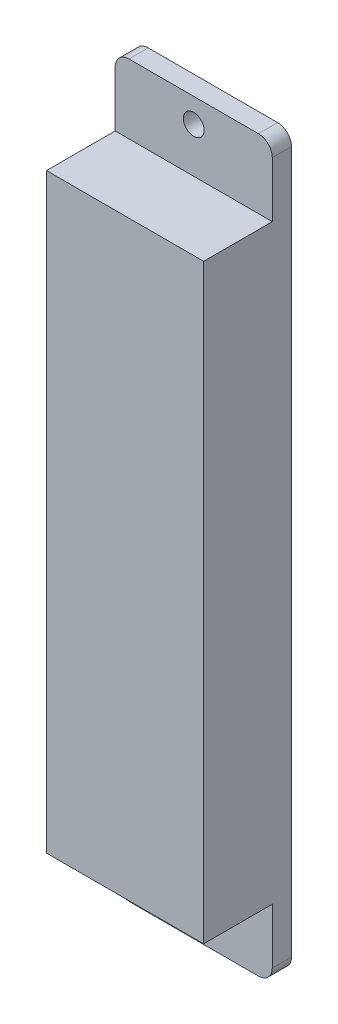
ISO-10303-21;
HEADER;
FILE_DESCRIPTION(('STEP AP214'),'2;1');
FILE_NAME('part.step','',(''),(''),'','','');
FILE_SCHEMA(('AUTOMOTIVE_DESIGN { 1 0 10303 214 1 1 1 1 }'));
ENDSEC;
DATA;
#1=APPLICATION_CONTEXT('core data for automotive mechanical design processes');
#2=APPLICATION_PROTOCOL_DEFINITION('international standard','automotive_design',2000,#1);
#3=PRODUCT_CONTEXT('',#1,'mechanical');
#4=PRODUCT('Part','Part','',(#3));
#5=PRODUCT_RELATED_PRODUCT_CATEGORY('part','',(#4));
#6=PRODUCT_DEFINITION_FORMATION('','',#4);
#7=PRODUCT_DEFINITION_CONTEXT('part definition',#1,'design');
#8=PRODUCT_DEFINITION('design','',#6,#7);
#9=PRODUCT_DEFINITION_SHAPE('','',#8);
#10=(LENGTH_UNIT() NAMED_UNIT(*) SI_UNIT(.MILLI.,.METRE.));
#11=(NAMED_UNIT(*) PLANE_ANGLE_UNIT() SI_UNIT($,.RADIAN.));
#12=(NAMED_UNIT(*) SI_UNIT($,.STERADIAN.) SOLID_ANGLE_UNIT());
#13=UNCERTAINTY_MEASURE_WITH_UNIT(LENGTH_MEASURE(1.E-05),#10,'distance_accuracy_value','');
#14=(GEOMETRIC_REPRESENTATION_CONTEXT(3) GLOBAL_UNCERTAINTY_ASSIGNED_CONTEXT((#13)) GLOBAL_UNIT_ASSIGNED_CONTEXT((#10,
#11,#12)) REPRESENTATION_CONTEXT('',''));
#15=CARTESIAN_POINT('',(0.,0.,0.));
#16=DIRECTION('',(0.,0.,1.));
#17=DIRECTION('',(1.,0.,0.));
#18=AXIS2_PLACEMENT_3D('',#15,#16,#17);
#19=CARTESIAN_POINT('',(0.,42.6999999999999,10.2));
#20=DIRECTION('',(0.,1.,0.));
#21=DIRECTION('',(0.,0.,1.));
#22=AXIS2_PLACEMENT_3D('',#19,#20,#21);
#23=PLANE('',#22);
#24=DIRECTION('',(0.,0.,-1.));
#25=VECTOR('',#24,1.);
#26=CARTESIAN_POINT('',(123.3,42.6999999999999,10.2));
#27=LINE('',#26,#25);
#28=CARTESIAN_POINT('',(123.3,42.6999999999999,12.7));
#29=VERTEX_POINT('',#28);
#30=CARTESIAN_POINT('',(123.3,42.7000000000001,2.77863936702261));
#31=VERTEX_POINT('',#30);
#32=EDGE_CURVE('E159',#29,#31,#27,.T.);
#33=ORIENTED_EDGE('',*,*,#32,.T.);
#34=DIRECTION('',(-1.,0.,0.));
#35=VECTOR('',#34,1.);
#36=CARTESIAN_POINT('',(0.,42.7000000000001,2.7786393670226));
#37=LINE('',#36,#35);
#38=CARTESIAN_POINT('',(100.6,42.6999999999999,2.77863936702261));
#39=VERTEX_POINT('',#38);
#40=EDGE_CURVE('E168',#31,#39,#37,.T.);
#41=ORIENTED_EDGE('',*,*,#40,.T.);
#42=DIRECTION('',(0.,0.,-1.));
#43=VECTOR('',#42,1.);
#44=CARTESIAN_POINT('',(100.6,42.6999999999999,10.2));
#45=LINE('',#44,#43);
#46=CARTESIAN_POINT('',(100.6,42.6999999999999,12.7));
#47=VERTEX_POINT('',#46);
#48=EDGE_CURVE('E180',#47,#39,#45,.T.);
#49=ORIENTED_EDGE('',*,*,#48,.F.);
#50=DIRECTION('',(-1.,0.,0.));
#51=VECTOR('',#50,1.);
#52=CARTESIAN_POINT('',(0.,42.6999999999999,12.7));
#53=LINE('',#52,#51);
#54=EDGE_CURVE('E178',#29,#47,#53,.T.);
#55=ORIENTED_EDGE('',*,*,#54,.F.);
#56=EDGE_LOOP('',(#33,#41,#49,#55));
#57=FACE_BOUND('',#56,.T.);
#58=ADVANCED_FACE('F42',(#57),#23,.T.);
#59=CARTESIAN_POINT('',(0.,-42.7000000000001,10.2));
#60=DIRECTION('',(0.,1.,0.));
#61=DIRECTION('',(0.,0.,1.));
#62=AXIS2_PLACEMENT_3D('',#59,#60,#61);
#63=PLANE('',#62);
#64=DIRECTION('',(-1.,0.,0.));
#65=VECTOR('',#64,1.);
#66=CARTESIAN_POINT('',(0.,-42.7000000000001,2.7786393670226));
#67=LINE('',#66,#65);
#68=CARTESIAN_POINT('',(123.3,-42.7000000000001,2.77863936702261));
#69=VERTEX_POINT('',#68);
#70=CARTESIAN_POINT('',(100.6,-42.7000000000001,2.77863936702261));
#71=VERTEX_POINT('',#70);
#72=EDGE_CURVE('E229',#69,#71,#67,.T.);
#73=ORIENTED_EDGE('',*,*,#72,.F.);
#74=DIRECTION('',(0.,0.,-1.));
#75=VECTOR('',#74,1.);
#76=CARTESIAN_POINT('',(123.3,-42.7000000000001,10.2));
#77=LINE('',#76,#75);
#78=CARTESIAN_POINT('',(123.3,-42.7000000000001,12.7));
#79=VERTEX_POINT('',#78);
#80=EDGE_CURVE('E179',#79,#69,#77,.T.);
#81=ORIENTED_EDGE('',*,*,#80,.F.);
#82=DIRECTION('',(1.,0.,0.));
#83=VECTOR('',#82,1.);
#84=CARTESIAN_POINT('',(0.,-42.7000000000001,12.7));
#85=LINE('',#84,#83);
#86=CARTESIAN_POINT('',(100.6,-42.7000000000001,12.7));
#87=VERTEX_POINT('',#86);
#88=EDGE_CURVE('E261',#87,#79,#85,.T.);
#89=ORIENTED_EDGE('',*,*,#88,.F.);
#90=DIRECTION('',(0.,0.,-1.));
#91=VECTOR('',#90,1.);
#92=CARTESIAN_POINT('',(100.6,-42.7000000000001,10.2));
#93=LINE('',#92,#91);
#94=EDGE_CURVE('E183',#87,#71,#93,.T.);
#95=ORIENTED_EDGE('',*,*,#94,.T.);
#96=EDGE_LOOP('',(#73,#81,#89,#95));
#97=FACE_BOUND('',#96,.T.);
#98=ADVANCED_FACE('F312',(#97),#63,.F.);
#99=CARTESIAN_POINT('',(0.,-40.2000000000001,10.2));
#100=DIRECTION('',(0.,1.,0.));
#101=DIRECTION('',(0.,0.,1.));
#102=AXIS2_PLACEMENT_3D('',#99,#100,#101);
#103=PLANE('',#102);
#104=DIRECTION('',(1.,0.,0.));
#105=VECTOR('',#104,1.);
#106=CARTESIAN_POINT('',(0.,-40.2000000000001,0.));
#107=LINE('',#106,#105);
#108=CARTESIAN_POINT('',(100.6,-40.2000000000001,0.));
#109=VERTEX_POINT('',#108);
#110=CARTESIAN_POINT('',(115.8,-40.2000000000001,0.));
#111=VERTEX_POINT('',#110);
#112=EDGE_CURVE('E267',#109,#111,#107,.T.);
#113=ORIENTED_EDGE('',*,*,#112,.F.);
#114=DIRECTION('',(0.,0.,-1.));
#115=VECTOR('',#114,1.);
#116=CARTESIAN_POINT('',(100.6,-40.2000000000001,10.2));
#117=LINE('',#116,#115);
#118=CARTESIAN_POINT('',(100.6,-40.2000000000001,10.2));
#119=VERTEX_POINT('',#118);
#120=EDGE_CURVE('E191',#119,#109,#117,.T.);
#121=ORIENTED_EDGE('',*,*,#120,.F.);
#122=DIRECTION('',(1.,0.,0.));
#123=VECTOR('',#122,1.);
#124=CARTESIAN_POINT('',(0.,-40.2000000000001,10.2));
#125=LINE('',#124,#123);
#126=CARTESIAN_POINT('',(115.8,-40.2000000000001,10.2));
#127=VERTEX_POINT('',#126);
#128=EDGE_CURVE('E269',#119,#127,#125,.T.);
#129=ORIENTED_EDGE('',*,*,#128,.T.);
#130=DIRECTION('',(0.,0.,-1.));
#131=VECTOR('',#130,1.);
#132=CARTESIAN_POINT('',(115.8,-40.2000000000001,10.2));
#133=LINE('',#132,#131);
#134=EDGE_CURVE('E278',#127,#111,#133,.T.);
#135=ORIENTED_EDGE('',*,*,#134,.T.);
#136=EDGE_LOOP('',(#113,#121,#129,#135));
#137=FACE_BOUND('',#136,.T.);
#138=ADVANCED_FACE('F310',(#137),#103,.T.);
#139=CARTESIAN_POINT('',(123.3,0.,10.2));
#140=DIRECTION('',(1.,0.,0.));
#141=DIRECTION('',(0.,1.,0.));
#142=AXIS2_PLACEMENT_3D('',#139,#140,#141);
#143=PLANE('',#142);
#144=DIRECTION('',(0.,1.,0.));
#145=VECTOR('',#144,1.);
#146=CARTESIAN_POINT('',(123.3,-52.7000000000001,2.77863936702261));
#147=LINE('',#146,#145);
#148=CARTESIAN_POINT('',(123.3,-50.7000000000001,2.77863936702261));
#149=VERTEX_POINT('',#148);
#150=EDGE_CURVE('E256',#149,#69,#147,.T.);
#151=ORIENTED_EDGE('',*,*,#150,.F.);
#152=DIRECTION('',(0.,0.,1.));
#153=VECTOR('',#152,1.);
#154=CARTESIAN_POINT('',(123.3,-50.7000000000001,10.2));
#155=LINE('',#154,#153);
#156=CARTESIAN_POINT('',(123.3,-50.7000000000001,0.));
#157=VERTEX_POINT('',#156);
#158=EDGE_CURVE('E204',#149,#157,#155,.F.);
#159=ORIENTED_EDGE('',*,*,#158,.T.);
#160=DIRECTION('',(0.,-1.,0.));
#161=VECTOR('',#160,1.);
#162=CARTESIAN_POINT('',(123.3,0.,0.));
#163=LINE('',#162,#161);
#164=CARTESIAN_POINT('',(123.3,50.7000000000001,0.));
#165=VERTEX_POINT('',#164);
#166=EDGE_CURVE('E283',#165,#157,#163,.T.);
#167=ORIENTED_EDGE('',*,*,#166,.F.);
#168=DIRECTION('',(0.,0.,1.));
#169=VECTOR('',#168,1.);
#170=CARTESIAN_POINT('',(123.3,50.7000000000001,10.2));
#171=LINE('',#170,#169);
#172=CARTESIAN_POINT('',(123.3,50.7000000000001,2.77863936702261));
#173=VERTEX_POINT('',#172);
#174=EDGE_CURVE('E163',#165,#173,#171,.T.);
#175=ORIENTED_EDGE('',*,*,#174,.T.);
#176=DIRECTION('',(0.,-1.,0.));
#177=VECTOR('',#176,1.);
#178=CARTESIAN_POINT('',(123.3,52.7000000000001,2.77863936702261));
#179=LINE('',#178,#177);
#180=EDGE_CURVE('E153',#173,#31,#179,.T.);
#181=ORIENTED_EDGE('',*,*,#180,.T.);
#182=ORIENTED_EDGE('',*,*,#32,.F.);
#183=DIRECTION('',(0.,1.,0.));
#184=VECTOR('',#183,1.);
#185=CARTESIAN_POINT('',(123.3,0.,12.7));
#186=LINE('',#185,#184);
#187=EDGE_CURVE('E264',#79,#29,#186,.T.);
#188=ORIENTED_EDGE('',*,*,#187,.F.);
#189=ORIENTED_EDGE('',*,*,#80,.T.);
#190=EDGE_LOOP('',(#151,#159,#167,#175,#181,#182,#188,#189));
#191=FACE_BOUND('',#190,.T.);
#192=ADVANCED_FACE('F156',(#191),#143,.T.);
#193=CARTESIAN_POINT('',(100.6,0.,10.2));
#194=DIRECTION('',(1.,0.,0.));
#195=DIRECTION('',(0.,0.,-1.));
#196=AXIS2_PLACEMENT_3D('',#193,#194,#195);
#197=PLANE('',#196);
#198=DIRECTION('',(0.,-1.,0.));
#199=VECTOR('',#198,1.);
#200=CARTESIAN_POINT('',(100.6,0.,0.));
#201=LINE('',#200,#199);
#202=CARTESIAN_POINT('',(100.6,-50.7000000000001,0.));
#203=VERTEX_POINT('',#202);
#204=EDGE_CURVE('E281',#109,#203,#201,.T.);
#205=ORIENTED_EDGE('',*,*,#204,.T.);
#206=DIRECTION('',(0.,0.,-1.));
#207=VECTOR('',#206,1.);
#208=CARTESIAN_POINT('',(100.6,-50.7000000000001,2.77863936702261));
#209=LINE('',#208,#207);
#210=CARTESIAN_POINT('',(100.6,-50.7000000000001,2.77863936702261));
#211=VERTEX_POINT('',#210);
#212=EDGE_CURVE('E217',#203,#211,#209,.F.);
#213=ORIENTED_EDGE('',*,*,#212,.T.);
#214=DIRECTION('',(0.,1.,0.));
#215=VECTOR('',#214,1.);
#216=CARTESIAN_POINT('',(100.6,-52.7000000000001,2.77863936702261));
#217=LINE('',#216,#215);
#218=EDGE_CURVE('E252',#211,#71,#217,.T.);
#219=ORIENTED_EDGE('',*,*,#218,.T.);
#220=ORIENTED_EDGE('',*,*,#94,.F.);
#221=DIRECTION('',(0.,1.,0.));
#222=VECTOR('',#221,1.);
#223=CARTESIAN_POINT('',(100.6,0.,12.7));
#224=LINE('',#223,#222);
#225=EDGE_CURVE('E259',#87,#47,#224,.T.);
#226=ORIENTED_EDGE('',*,*,#225,.T.);
#227=ORIENTED_EDGE('',*,*,#48,.T.);
#228=DIRECTION('',(0.,-1.,0.));
#229=VECTOR('',#228,1.);
#230=CARTESIAN_POINT('',(100.6,52.7000000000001,2.77863936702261));
#231=LINE('',#230,#229);
#232=CARTESIAN_POINT('',(100.6,50.7000000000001,2.77863936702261));
#233=VERTEX_POINT('',#232);
#234=EDGE_CURVE('E164',#233,#39,#231,.T.);
#235=ORIENTED_EDGE('',*,*,#234,.F.);
#236=DIRECTION('',(0.,0.,-1.));
#237=VECTOR('',#236,1.);
#238=CARTESIAN_POINT('',(100.6,50.7000000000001,0.));
#239=LINE('',#238,#237);
#240=CARTESIAN_POINT('',(100.6,50.7000000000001,0.));
#241=VERTEX_POINT('',#240);
#242=EDGE_CURVE('E214',#233,#241,#239,.T.);
#243=ORIENTED_EDGE('',*,*,#242,.T.);
#244=DIRECTION('',(0.,-1.,0.));
#245=VECTOR('',#244,1.);
#246=CARTESIAN_POINT('',(100.6,0.,0.));
#247=LINE('',#246,#245);
#248=CARTESIAN_POINT('',(100.6,40.1999999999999,0.));
#249=VERTEX_POINT('',#248);
#250=EDGE_CURVE('E237',#241,#249,#247,.T.);
#251=ORIENTED_EDGE('',*,*,#250,.T.);
#252=DIRECTION('',(0.,0.,-1.));
#253=VECTOR('',#252,1.);
#254=CARTESIAN_POINT('',(100.6,40.1999999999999,10.2));
#255=LINE('',#254,#253);
#256=CARTESIAN_POINT('',(100.6,40.1999999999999,10.2));
#257=VERTEX_POINT('',#256);
#258=EDGE_CURVE('E185',#257,#249,#255,.T.);
#259=ORIENTED_EDGE('',*,*,#258,.F.);
#260=DIRECTION('',(0.,1.,0.));
#261=VECTOR('',#260,1.);
#262=CARTESIAN_POINT('',(100.6,0.,10.2));
#263=LINE('',#262,#261);
#264=EDGE_CURVE('E258',#119,#257,#263,.T.);
#265=ORIENTED_EDGE('',*,*,#264,.F.);
#266=ORIENTED_EDGE('',*,*,#120,.T.);
#267=EDGE_LOOP('',(#205,#213,#219,#220,#226,#227,#235,#243,#251,#259,#265,#266));
#268=FACE_BOUND('',#267,.T.);
#269=ADVANCED_FACE('F226',(#268),#197,.F.);
#270=CARTESIAN_POINT('',(0.,40.1999999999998,10.2));
#271=DIRECTION('',(0.,1.,0.));
#272=DIRECTION('',(-1.,0.,0.));
#273=AXIS2_PLACEMENT_3D('',#270,#271,#272);
#274=PLANE('',#273);
#275=DIRECTION('',(1.,0.,0.));
#276=VECTOR('',#275,1.);
#277=CARTESIAN_POINT('',(0.,40.1999999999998,0.));
#278=LINE('',#277,#276);
#279=CARTESIAN_POINT('',(115.8,40.1999999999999,0.));
#280=VERTEX_POINT('',#279);
#281=EDGE_CURVE('E286',#249,#280,#278,.T.);
#282=ORIENTED_EDGE('',*,*,#281,.T.);
#283=DIRECTION('',(0.,0.,-1.));
#284=VECTOR('',#283,1.);
#285=CARTESIAN_POINT('',(115.8,40.1999999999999,10.2));
#286=LINE('',#285,#284);
#287=CARTESIAN_POINT('',(115.8,40.1999999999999,10.2));
#288=VERTEX_POINT('',#287);
#289=EDGE_CURVE('E292',#288,#280,#286,.T.);
#290=ORIENTED_EDGE('',*,*,#289,.F.);
#291=DIRECTION('',(1.,0.,0.));
#292=VECTOR('',#291,1.);
#293=CARTESIAN_POINT('',(0.,40.1999999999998,10.2));
#294=LINE('',#293,#292);
#295=EDGE_CURVE('E272',#257,#288,#294,.T.);
#296=ORIENTED_EDGE('',*,*,#295,.F.);
#297=ORIENTED_EDGE('',*,*,#258,.T.);
#298=EDGE_LOOP('',(#282,#290,#296,#297));
#299=FACE_BOUND('',#298,.T.);
#300=ADVANCED_FACE('F297',(#299),#274,.F.);
#301=CARTESIAN_POINT('',(115.8,0.,10.2));
#302=DIRECTION('',(-1.,0.,0.));
#303=DIRECTION('',(0.,-1.,0.));
#304=AXIS2_PLACEMENT_3D('',#301,#302,#303);
#305=PLANE('',#304);
#306=DIRECTION('',(0.,1.,0.));
#307=VECTOR('',#306,1.);
#308=CARTESIAN_POINT('',(115.8,0.,0.));
#309=LINE('',#308,#307);
#310=EDGE_CURVE('E273',#111,#280,#309,.T.);
#311=ORIENTED_EDGE('',*,*,#310,.F.);
#312=ORIENTED_EDGE('',*,*,#134,.F.);
#313=DIRECTION('',(0.,1.,0.));
#314=VECTOR('',#313,1.);
#315=CARTESIAN_POINT('',(115.8,0.,10.2));
#316=LINE('',#315,#314);
#317=EDGE_CURVE('E275',#127,#288,#316,.T.);
#318=ORIENTED_EDGE('',*,*,#317,.T.);
#319=ORIENTED_EDGE('',*,*,#289,.T.);
#320=EDGE_LOOP('',(#311,#312,#318,#319));
#321=FACE_BOUND('',#320,.T.);
#322=ADVANCED_FACE('F305',(#321),#305,.T.);
#323=CARTESIAN_POINT('',(0.,0.,0.));
#324=DIRECTION('',(0.,0.,1.));
#325=DIRECTION('',(1.,0.,0.));
#326=AXIS2_PLACEMENT_3D('',#323,#324,#325);
#327=PLANE('',#326);
#328=CARTESIAN_POINT('',(111.95,-49.1999999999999,0.));
#329=DIRECTION('',(0.,0.,-1.));
#330=DIRECTION('',(1.,0.,0.));
#331=AXIS2_PLACEMENT_3D('',#328,#329,#330);
#332=CIRCLE('',#331,1.5);
#333=CARTESIAN_POINT('',(113.45,-49.1999999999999,0.));
#334=VERTEX_POINT('',#333);
#335=EDGE_CURVE('E370',#334,#334,#332,.T.);
#336=ORIENTED_EDGE('',*,*,#335,.F.);
#337=EDGE_LOOP('',(#336));
#338=FACE_BOUND('',#337,.T.);
#339=CARTESIAN_POINT('',(111.95,49.1999999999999,0.));
#340=DIRECTION('',(0.,0.,1.));
#341=DIRECTION('',(1.,0.,0.));
#342=AXIS2_PLACEMENT_3D('',#339,#340,#341);
#343=CIRCLE('',#342,1.5);
#344=CARTESIAN_POINT('',(113.45,49.1999999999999,0.));
#345=VERTEX_POINT('',#344);
#346=EDGE_CURVE('E174',#345,#345,#343,.T.);
#347=ORIENTED_EDGE('',*,*,#346,.T.);
#348=EDGE_LOOP('',(#347));
#349=FACE_BOUND('',#348,.T.);
#350=ORIENTED_EDGE('',*,*,#166,.T.);
#351=CARTESIAN_POINT('',(121.3,-50.7000000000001,0.));
#352=DIRECTION('',(0.,0.,1.));
#353=DIRECTION('',(1.,0.,0.));
#354=AXIS2_PLACEMENT_3D('',#351,#352,#353);
#355=CIRCLE('',#354,2.);
#356=CARTESIAN_POINT('',(121.3,-52.7000000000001,0.));
#357=VERTEX_POINT('',#356);
#358=EDGE_CURVE('E212',#157,#357,#355,.F.);
#359=ORIENTED_EDGE('',*,*,#358,.T.);
#360=DIRECTION('',(1.,0.,0.));
#361=VECTOR('',#360,1.);
#362=CARTESIAN_POINT('',(0.,-52.7000000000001,0.));
#363=LINE('',#362,#361);
#364=CARTESIAN_POINT('',(102.6,-52.7000000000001,0.));
#365=VERTEX_POINT('',#364);
#366=EDGE_CURVE('E249',#365,#357,#363,.T.);
#367=ORIENTED_EDGE('',*,*,#366,.F.);
#368=CARTESIAN_POINT('',(102.6,-50.7000000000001,0.));
#369=DIRECTION('',(0.,0.,1.));
#370=DIRECTION('',(1.,0.,0.));
#371=AXIS2_PLACEMENT_3D('',#368,#369,#370);
#372=CIRCLE('',#371,2.);
#373=EDGE_CURVE('E210',#365,#203,#372,.F.);
#374=ORIENTED_EDGE('',*,*,#373,.T.);
#375=ORIENTED_EDGE('',*,*,#204,.F.);
#376=ORIENTED_EDGE('',*,*,#112,.T.);
#377=ORIENTED_EDGE('',*,*,#310,.T.);
#378=ORIENTED_EDGE('',*,*,#281,.F.);
#379=ORIENTED_EDGE('',*,*,#250,.F.);
#380=CARTESIAN_POINT('',(102.6,50.7000000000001,0.));
#381=DIRECTION('',(0.,0.,1.));
#382=DIRECTION('',(1.,0.,0.));
#383=AXIS2_PLACEMENT_3D('',#380,#381,#382);
#384=CIRCLE('',#383,2.);
#385=CARTESIAN_POINT('',(102.6,52.7000000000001,0.));
#386=VERTEX_POINT('',#385);
#387=EDGE_CURVE('E206',#241,#386,#384,.F.);
#388=ORIENTED_EDGE('',*,*,#387,.T.);
#389=DIRECTION('',(1.,0.,0.));
#390=VECTOR('',#389,1.);
#391=CARTESIAN_POINT('',(0.,52.7000000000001,0.));
#392=LINE('',#391,#390);
#393=CARTESIAN_POINT('',(121.3,52.7000000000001,0.));
#394=VERTEX_POINT('',#393);
#395=EDGE_CURVE('E173',#386,#394,#392,.T.);
#396=ORIENTED_EDGE('',*,*,#395,.T.);
#397=CARTESIAN_POINT('',(121.3,50.7000000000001,0.));
#398=DIRECTION('',(0.,0.,1.));
#399=DIRECTION('',(1.,0.,0.));
#400=AXIS2_PLACEMENT_3D('',#397,#398,#399);
#401=CIRCLE('',#400,2.);
#402=EDGE_CURVE('E208',#394,#165,#401,.F.);
#403=ORIENTED_EDGE('',*,*,#402,.T.);
#404=EDGE_LOOP('',(#350,#359,#367,#374,#375,#376,#377,#378,#379,#388,#396,#403));
#405=FACE_BOUND('',#404,.T.);
#406=ADVANCED_FACE('F234',(#338,#349,#405),#327,.F.);
#407=CARTESIAN_POINT('',(0.,0.,12.7));
#408=DIRECTION('',(0.,0.,1.));
#409=DIRECTION('',(1.,0.,0.));
#410=AXIS2_PLACEMENT_3D('',#407,#408,#409);
#411=PLANE('',#410);
#412=ORIENTED_EDGE('',*,*,#225,.F.);
#413=ORIENTED_EDGE('',*,*,#88,.T.);
#414=ORIENTED_EDGE('',*,*,#187,.T.);
#415=ORIENTED_EDGE('',*,*,#54,.T.);
#416=EDGE_LOOP('',(#412,#413,#414,#415));
#417=FACE_BOUND('',#416,.T.);
#418=ADVANCED_FACE('F336',(#417),#411,.T.);
#419=CARTESIAN_POINT('',(0.,0.,10.2));
#420=DIRECTION('',(0.,0.,1.));
#421=DIRECTION('',(1.,0.,0.));
#422=AXIS2_PLACEMENT_3D('',#419,#420,#421);
#423=PLANE('',#422);
#424=ORIENTED_EDGE('',*,*,#128,.F.);
#425=ORIENTED_EDGE('',*,*,#264,.T.);
#426=ORIENTED_EDGE('',*,*,#295,.T.);
#427=ORIENTED_EDGE('',*,*,#317,.F.);
#428=EDGE_LOOP('',(#424,#425,#426,#427));
#429=FACE_BOUND('',#428,.T.);
#430=ADVANCED_FACE('F307',(#429),#423,.F.);
#431=CARTESIAN_POINT('',(0.,-52.7000000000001,2.7786393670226));
#432=DIRECTION('',(0.,0.,-1.));
#433=DIRECTION('',(-1.,0.,0.));
#434=AXIS2_PLACEMENT_3D('',#431,#432,#433);
#435=PLANE('',#434);
#436=CARTESIAN_POINT('',(111.95,-49.1999999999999,2.7786393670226));
#437=DIRECTION('',(0.,0.,-1.));
#438=DIRECTION('',(1.,0.,0.));
#439=AXIS2_PLACEMENT_3D('',#436,#437,#438);
#440=CIRCLE('',#439,1.5);
#441=CARTESIAN_POINT('',(113.45,-49.1999999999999,2.7786393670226));
#442=VERTEX_POINT('',#441);
#443=EDGE_CURVE('E373',#442,#442,#440,.T.);
#444=ORIENTED_EDGE('',*,*,#443,.T.);
#445=EDGE_LOOP('',(#444));
#446=FACE_BOUND('',#445,.T.);
#447=DIRECTION('',(-1.,0.,0.));
#448=VECTOR('',#447,1.);
#449=CARTESIAN_POINT('',(0.,-52.7000000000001,2.7786393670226));
#450=LINE('',#449,#448);
#451=CARTESIAN_POINT('',(121.3,-52.7000000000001,2.77863936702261));
#452=VERTEX_POINT('',#451);
#453=CARTESIAN_POINT('',(102.6,-52.7000000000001,2.77863936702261));
#454=VERTEX_POINT('',#453);
#455=EDGE_CURVE('E246',#452,#454,#450,.T.);
#456=ORIENTED_EDGE('',*,*,#455,.F.);
#457=CARTESIAN_POINT('',(121.3,-50.7000000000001,2.77863936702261));
#458=DIRECTION('',(0.,0.,-1.));
#459=DIRECTION('',(-1.,0.,0.));
#460=AXIS2_PLACEMENT_3D('',#457,#458,#459);
#461=CIRCLE('',#460,2.);
#462=EDGE_CURVE('E201',#452,#149,#461,.F.);
#463=ORIENTED_EDGE('',*,*,#462,.T.);
#464=ORIENTED_EDGE('',*,*,#150,.T.);
#465=ORIENTED_EDGE('',*,*,#72,.T.);
#466=ORIENTED_EDGE('',*,*,#218,.F.);
#467=CARTESIAN_POINT('',(102.6,-50.7000000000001,2.77863936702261));
#468=DIRECTION('',(0.,0.,-1.));
#469=DIRECTION('',(-1.,0.,0.));
#470=AXIS2_PLACEMENT_3D('',#467,#468,#469);
#471=CIRCLE('',#470,2.);
#472=EDGE_CURVE('E199',#211,#454,#471,.F.);
#473=ORIENTED_EDGE('',*,*,#472,.T.);
#474=EDGE_LOOP('',(#456,#463,#464,#465,#466,#473));
#475=FACE_BOUND('',#474,.T.);
#476=ADVANCED_FACE('F340',(#446,#475),#435,.F.);
#477=CARTESIAN_POINT('',(0.,-52.7000000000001,0.));
#478=DIRECTION('',(0.,-1.,0.));
#479=DIRECTION('',(0.,0.,-1.));
#480=AXIS2_PLACEMENT_3D('',#477,#478,#479);
#481=PLANE('',#480);
#482=ORIENTED_EDGE('',*,*,#366,.T.);
#483=DIRECTION('',(0.,0.,1.));
#484=VECTOR('',#483,1.);
#485=CARTESIAN_POINT('',(121.3,-52.7000000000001,0.));
#486=LINE('',#485,#484);
#487=EDGE_CURVE('E196',#357,#452,#486,.T.);
#488=ORIENTED_EDGE('',*,*,#487,.T.);
#489=ORIENTED_EDGE('',*,*,#455,.T.);
#490=DIRECTION('',(0.,0.,-1.));
#491=VECTOR('',#490,1.);
#492=CARTESIAN_POINT('',(102.6,-52.7000000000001,0.));
#493=LINE('',#492,#491);
#494=EDGE_CURVE('E193',#454,#365,#493,.T.);
#495=ORIENTED_EDGE('',*,*,#494,.T.);
#496=EDGE_LOOP('',(#482,#488,#489,#495));
#497=FACE_BOUND('',#496,.T.);
#498=ADVANCED_FACE('F346',(#497),#481,.T.);
#499=CARTESIAN_POINT('',(0.,52.7000000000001,2.7786393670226));
#500=DIRECTION('',(0.,0.,1.));
#501=DIRECTION('',(1.,0.,0.));
#502=AXIS2_PLACEMENT_3D('',#499,#500,#501);
#503=PLANE('',#502);
#504=CARTESIAN_POINT('',(111.95,49.1999999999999,2.7786393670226));
#505=DIRECTION('',(0.,0.,1.));
#506=DIRECTION('',(1.,0.,0.));
#507=AXIS2_PLACEMENT_3D('',#504,#505,#506);
#508=CIRCLE('',#507,1.5);
#509=CARTESIAN_POINT('',(113.45,49.1999999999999,2.7786393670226));
#510=VERTEX_POINT('',#509);
#511=EDGE_CURVE('E243',#510,#510,#508,.T.);
#512=ORIENTED_EDGE('',*,*,#511,.F.);
#513=EDGE_LOOP('',(#512));
#514=FACE_BOUND('',#513,.T.);
#515=ORIENTED_EDGE('',*,*,#180,.F.);
#516=CARTESIAN_POINT('',(121.3,50.7000000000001,2.77863936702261));
#517=DIRECTION('',(0.,0.,1.));
#518=DIRECTION('',(1.,0.,0.));
#519=AXIS2_PLACEMENT_3D('',#516,#517,#518);
#520=CIRCLE('',#519,2.);
#521=CARTESIAN_POINT('',(121.3,52.7000000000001,2.77863936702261));
#522=VERTEX_POINT('',#521);
#523=EDGE_CURVE('E63',#173,#522,#520,.T.);
#524=ORIENTED_EDGE('',*,*,#523,.T.);
#525=DIRECTION('',(-1.,0.,0.));
#526=VECTOR('',#525,1.);
#527=CARTESIAN_POINT('',(0.,52.7000000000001,2.7786393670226));
#528=LINE('',#527,#526);
#529=CARTESIAN_POINT('',(102.6,52.7000000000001,2.77863936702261));
#530=VERTEX_POINT('',#529);
#531=EDGE_CURVE('E165',#522,#530,#528,.T.);
#532=ORIENTED_EDGE('',*,*,#531,.T.);
#533=CARTESIAN_POINT('',(102.6,50.7000000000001,2.77863936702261));
#534=DIRECTION('',(0.,0.,1.));
#535=DIRECTION('',(1.,0.,0.));
#536=AXIS2_PLACEMENT_3D('',#533,#534,#535);
#537=CIRCLE('',#536,2.);
#538=EDGE_CURVE('E219',#530,#233,#537,.T.);
#539=ORIENTED_EDGE('',*,*,#538,.T.);
#540=ORIENTED_EDGE('',*,*,#234,.T.);
#541=ORIENTED_EDGE('',*,*,#40,.F.);
#542=EDGE_LOOP('',(#515,#524,#532,#539,#540,#541));
#543=FACE_BOUND('',#542,.T.);
#544=ADVANCED_FACE('F169',(#514,#543),#503,.T.);
#545=CARTESIAN_POINT('',(0.,52.7000000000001,0.));
#546=DIRECTION('',(0.,1.,0.));
#547=DIRECTION('',(0.,0.,-1.));
#548=AXIS2_PLACEMENT_3D('',#545,#546,#547);
#549=PLANE('',#548);
#550=ORIENTED_EDGE('',*,*,#531,.F.);
#551=DIRECTION('',(0.,0.,1.));
#552=VECTOR('',#551,1.);
#553=CARTESIAN_POINT('',(121.3,52.7000000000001,0.));
#554=LINE('',#553,#552);
#555=EDGE_CURVE('E12',#522,#394,#554,.F.);
#556=ORIENTED_EDGE('',*,*,#555,.T.);
#557=ORIENTED_EDGE('',*,*,#395,.F.);
#558=DIRECTION('',(0.,0.,-1.));
#559=VECTOR('',#558,1.);
#560=CARTESIAN_POINT('',(102.6,52.7000000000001,2.77863936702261));
#561=LINE('',#560,#559);
#562=EDGE_CURVE('E50',#386,#530,#561,.F.);
#563=ORIENTED_EDGE('',*,*,#562,.T.);
#564=EDGE_LOOP('',(#550,#556,#557,#563));
#565=FACE_BOUND('',#564,.T.);
#566=ADVANCED_FACE('F238',(#565),#549,.T.);
#567=CARTESIAN_POINT('',(111.95,49.1999999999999,0.));
#568=DIRECTION('',(0.,0.,1.));
#569=DIRECTION('',(1.,0.,0.));
#570=AXIS2_PLACEMENT_3D('',#567,#568,#569);
#571=CYLINDRICAL_SURFACE('',#570,1.5);
#572=ORIENTED_EDGE('',*,*,#346,.F.);
#573=EDGE_LOOP('',(#572));
#574=FACE_BOUND('',#573,.T.);
#575=ORIENTED_EDGE('',*,*,#511,.T.);
#576=EDGE_LOOP('',(#575));
#577=FACE_BOUND('',#576,.T.);
#578=ADVANCED_FACE('F356',(#574,#577),#571,.F.);
#579=CARTESIAN_POINT('',(121.3,-50.7000000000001,0.));
#580=DIRECTION('',(0.,0.,1.));
#581=DIRECTION('',(1.,0.,0.));
#582=AXIS2_PLACEMENT_3D('',#579,#580,#581);
#583=CYLINDRICAL_SURFACE('',#582,2.);
#584=ORIENTED_EDGE('',*,*,#358,.F.);
#585=ORIENTED_EDGE('',*,*,#158,.F.);
#586=ORIENTED_EDGE('',*,*,#462,.F.);
#587=ORIENTED_EDGE('',*,*,#487,.F.);
#588=EDGE_LOOP('',(#584,#585,#586,#587));
#589=FACE_BOUND('',#588,.T.);
#590=ADVANCED_FACE('F358',(#589),#583,.T.);
#591=CARTESIAN_POINT('',(102.6,-50.7000000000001,0.));
#592=DIRECTION('',(0.,0.,1.));
#593=DIRECTION('',(1.,0.,0.));
#594=AXIS2_PLACEMENT_3D('',#591,#592,#593);
#595=CYLINDRICAL_SURFACE('',#594,2.);
#596=ORIENTED_EDGE('',*,*,#472,.F.);
#597=ORIENTED_EDGE('',*,*,#212,.F.);
#598=ORIENTED_EDGE('',*,*,#373,.F.);
#599=ORIENTED_EDGE('',*,*,#494,.F.);
#600=EDGE_LOOP('',(#596,#597,#598,#599));
#601=FACE_BOUND('',#600,.T.);
#602=ADVANCED_FACE('F390',(#601),#595,.T.);
#603=CARTESIAN_POINT('',(121.3,50.7000000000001,10.2));
#604=DIRECTION('',(0.,0.,1.));
#605=DIRECTION('',(1.,0.,0.));
#606=AXIS2_PLACEMENT_3D('',#603,#604,#605);
#607=CYLINDRICAL_SURFACE('',#606,2.);
#608=ORIENTED_EDGE('',*,*,#402,.F.);
#609=ORIENTED_EDGE('',*,*,#555,.F.);
#610=ORIENTED_EDGE('',*,*,#523,.F.);
#611=ORIENTED_EDGE('',*,*,#174,.F.);
#612=EDGE_LOOP('',(#608,#609,#610,#611));
#613=FACE_BOUND('',#612,.T.);
#614=ADVANCED_FACE('F366',(#613),#607,.T.);
#615=CARTESIAN_POINT('',(102.6,50.7000000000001,10.2));
#616=DIRECTION('',(0.,0.,1.));
#617=DIRECTION('',(1.,0.,0.));
#618=AXIS2_PLACEMENT_3D('',#615,#616,#617);
#619=CYLINDRICAL_SURFACE('',#618,2.);
#620=ORIENTED_EDGE('',*,*,#538,.F.);
#621=ORIENTED_EDGE('',*,*,#562,.F.);
#622=ORIENTED_EDGE('',*,*,#387,.F.);
#623=ORIENTED_EDGE('',*,*,#242,.F.);
#624=EDGE_LOOP('',(#620,#621,#622,#623));
#625=FACE_BOUND('',#624,.T.);
#626=ADVANCED_FACE('F44',(#625),#619,.T.);
#627=CARTESIAN_POINT('',(111.95,-49.1999999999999,0.));
#628=DIRECTION('',(0.,0.,1.));
#629=DIRECTION('',(1.,0.,0.));
#630=AXIS2_PLACEMENT_3D('',#627,#628,#629);
#631=CYLINDRICAL_SURFACE('',#630,1.5);
#632=ORIENTED_EDGE('',*,*,#335,.T.);
#633=EDGE_LOOP('',(#632));
#634=FACE_BOUND('',#633,.T.);
#635=ORIENTED_EDGE('',*,*,#443,.F.);
#636=EDGE_LOOP('',(#635));
#637=FACE_BOUND('',#636,.T.);
#638=ADVANCED_FACE('F360',(#634,#637),#631,.F.);
#639=CLOSED_SHELL('',(#58,#98,#138,#192,#269,#300,#322,#406,#418,#430,#476,#498,#544,#566,#578,
#590,#602,#614,#626,#638));
#640=MANIFOLD_SOLID_BREP('B2',#639);
#641=ADVANCED_BREP_SHAPE_REPRESENTATION('',(#18,#640),#14);
#642=SHAPE_DEFINITION_REPRESENTATION(#9,#641);
ENDSEC;
END-ISO-10303-21;
